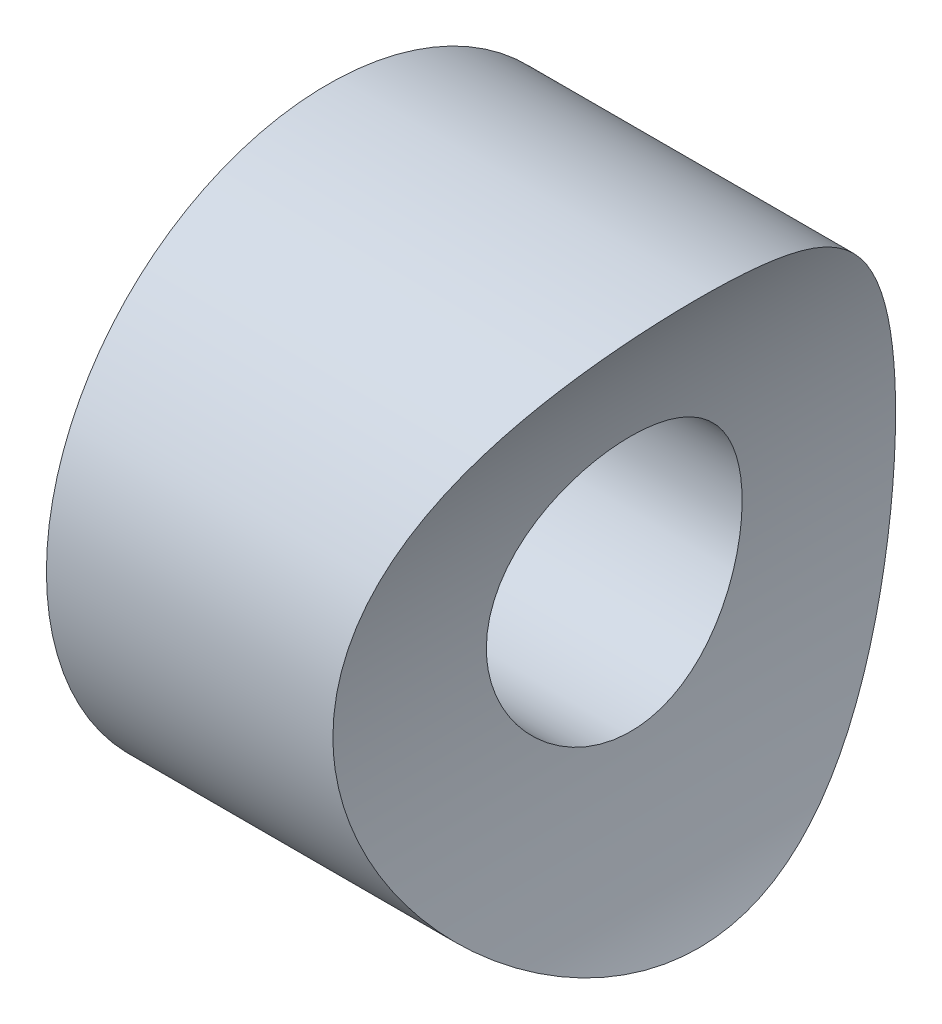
from build123d import *

# Parameters (mm, degrees)
SKETCH_1_R          = 27.5
SKETCH_1_R_2        = 12.5
EXTRUDE_1_DEPTH     = 40
SKETCH_2_R          = 50
CUT_EXTRUDE_1_DEPTH = 35


with BuildPart() as part:
    # Sketch 1 → Extrude 1 (new body)
    with BuildSketch(Plane(origin=(0, 0, 0), x_dir=(0, 0, -1), z_dir=(1, 0, 0))):
        Circle(SKETCH_1_R)
        Circle(SKETCH_1_R_2, mode=Mode.SUBTRACT)
    extrude(amount=EXTRUDE_1_DEPTH)

    # Sketch 2 → Cut-Extrude 1 (cut, symmetric)
    with BuildSketch(Plane.XY):
        with Locations((78, 0)):
            Circle(SKETCH_2_R)
    extrude(amount=CUT_EXTRUDE_1_DEPTH, both=True, mode=Mode.SUBTRACT)


solid = part.part
